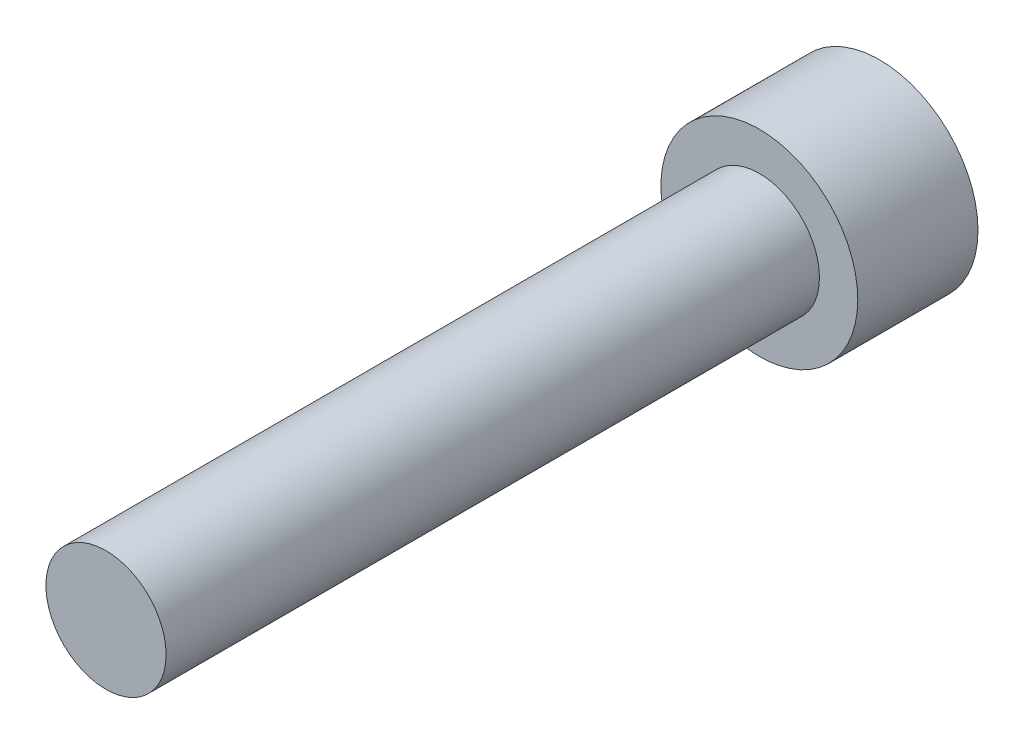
ISO-10303-21;
HEADER;
FILE_DESCRIPTION(('STEP AP214'),'2;1');
FILE_NAME('part.step','',(''),(''),'','','');
FILE_SCHEMA(('AUTOMOTIVE_DESIGN { 1 0 10303 214 1 1 1 1 }'));
ENDSEC;
DATA;
#1=APPLICATION_CONTEXT('core data for automotive mechanical design processes');
#2=APPLICATION_PROTOCOL_DEFINITION('international standard','automotive_design',2000,#1);
#3=PRODUCT_CONTEXT('',#1,'mechanical');
#4=PRODUCT('Part','Part','',(#3));
#5=PRODUCT_RELATED_PRODUCT_CATEGORY('part','',(#4));
#6=PRODUCT_DEFINITION_FORMATION('','',#4);
#7=PRODUCT_DEFINITION_CONTEXT('part definition',#1,'design');
#8=PRODUCT_DEFINITION('design','',#6,#7);
#9=PRODUCT_DEFINITION_SHAPE('','',#8);
#10=(LENGTH_UNIT() NAMED_UNIT(*) SI_UNIT(.MILLI.,.METRE.));
#11=(NAMED_UNIT(*) PLANE_ANGLE_UNIT() SI_UNIT($,.RADIAN.));
#12=(NAMED_UNIT(*) SI_UNIT($,.STERADIAN.) SOLID_ANGLE_UNIT());
#13=UNCERTAINTY_MEASURE_WITH_UNIT(LENGTH_MEASURE(1.E-05),#10,'distance_accuracy_value','');
#14=(GEOMETRIC_REPRESENTATION_CONTEXT(3) GLOBAL_UNCERTAINTY_ASSIGNED_CONTEXT((#13)) GLOBAL_UNIT_ASSIGNED_CONTEXT((#10,
#11,#12)) REPRESENTATION_CONTEXT('',''));
#15=CARTESIAN_POINT('',(0.,0.,0.));
#16=DIRECTION('',(0.,0.,1.));
#17=DIRECTION('',(1.,0.,0.));
#18=AXIS2_PLACEMENT_3D('',#15,#16,#17);
#19=CARTESIAN_POINT('',(0.,-2.8702,-3.5052));
#20=DIRECTION('',(0.,0.,-1.));
#21=DIRECTION('',(-1.,0.,0.));
#22=AXIS2_PLACEMENT_3D('',#19,#20,#21);
#23=PLANE('',#22);
#24=DIRECTION('',(0.866025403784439,-0.5,0.));
#25=VECTOR('',#24,1.);
#26=CARTESIAN_POINT('',(0.,1.5984519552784,-3.5052));
#27=LINE('',#26,#25);
#28=CARTESIAN_POINT('',(0.,1.5984519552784,-3.5052));
#29=VERTEX_POINT('',#28);
#30=CARTESIAN_POINT('',(1.3843,0.799225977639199,-3.5052));
#31=VERTEX_POINT('',#30);
#32=EDGE_CURVE('E46',#29,#31,#27,.T.);
#33=ORIENTED_EDGE('',*,*,#32,.F.);
#34=DIRECTION('',(0.866025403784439,0.5,0.));
#35=VECTOR('',#34,1.);
#36=CARTESIAN_POINT('',(-1.3843,0.7992259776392,-3.5052));
#37=LINE('',#36,#35);
#38=CARTESIAN_POINT('',(-1.3843,0.7992259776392,-3.5052));
#39=VERTEX_POINT('',#38);
#40=EDGE_CURVE('E129',#39,#29,#37,.T.);
#41=ORIENTED_EDGE('',*,*,#40,.F.);
#42=DIRECTION('',(0.,1.,0.));
#43=VECTOR('',#42,1.);
#44=CARTESIAN_POINT('',(-1.3843,-0.799225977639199,-3.5052));
#45=LINE('',#44,#43);
#46=CARTESIAN_POINT('',(-1.3843,-0.799225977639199,-3.5052));
#47=VERTEX_POINT('',#46);
#48=EDGE_CURVE('E127',#47,#39,#45,.T.);
#49=ORIENTED_EDGE('',*,*,#48,.F.);
#50=DIRECTION('',(-0.866025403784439,0.5,0.));
#51=VECTOR('',#50,1.);
#52=CARTESIAN_POINT('',(0.,-1.5984519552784,-3.5052));
#53=LINE('',#52,#51);
#54=CARTESIAN_POINT('',(0.,-1.5984519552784,-3.5052));
#55=VERTEX_POINT('',#54);
#56=EDGE_CURVE('E94',#55,#47,#53,.T.);
#57=ORIENTED_EDGE('',*,*,#56,.F.);
#58=DIRECTION('',(-0.866025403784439,-0.5,0.));
#59=VECTOR('',#58,1.);
#60=CARTESIAN_POINT('',(1.3843,-0.799225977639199,-3.5052));
#61=LINE('',#60,#59);
#62=CARTESIAN_POINT('',(1.3843,-0.799225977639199,-3.5052));
#63=VERTEX_POINT('',#62);
#64=EDGE_CURVE('E123',#63,#55,#61,.T.);
#65=ORIENTED_EDGE('',*,*,#64,.F.);
#66=DIRECTION('',(0.,-1.,0.));
#67=VECTOR('',#66,1.);
#68=CARTESIAN_POINT('',(1.3843,0.799225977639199,-3.5052));
#69=LINE('',#68,#67);
#70=EDGE_CURVE('E120',#31,#63,#69,.T.);
#71=ORIENTED_EDGE('',*,*,#70,.F.);
#72=EDGE_LOOP('',(#33,#41,#49,#57,#65,#71));
#73=FACE_BOUND('',#72,.T.);
#74=CARTESIAN_POINT('',(0.,0.,-3.5052));
#75=DIRECTION('',(0.,0.,1.));
#76=DIRECTION('',(1.,0.,0.));
#77=AXIS2_PLACEMENT_3D('',#74,#75,#76);
#78=CIRCLE('',#77,2.8702);
#79=CARTESIAN_POINT('',(2.8702,0.,-3.5052));
#80=VERTEX_POINT('',#79);
#81=EDGE_CURVE('E11',#80,#80,#78,.T.);
#82=ORIENTED_EDGE('',*,*,#81,.F.);
#83=EDGE_LOOP('',(#82));
#84=FACE_BOUND('',#83,.T.);
#85=ADVANCED_FACE('F32',(#73,#84),#23,.T.);
#86=CARTESIAN_POINT('',(0.,0.,19.05));
#87=DIRECTION('',(0.,0.,1.));
#88=DIRECTION('',(1.,0.,0.));
#89=AXIS2_PLACEMENT_3D('',#86,#87,#88);
#90=CYLINDRICAL_SURFACE('',#89,2.8702);
#91=ORIENTED_EDGE('',*,*,#81,.T.);
#92=EDGE_LOOP('',(#91));
#93=FACE_BOUND('',#92,.T.);
#94=CARTESIAN_POINT('',(0.,0.,0.));
#95=DIRECTION('',(0.,0.,1.));
#96=DIRECTION('',(1.,0.,0.));
#97=AXIS2_PLACEMENT_3D('',#94,#95,#96);
#98=CIRCLE('',#97,2.8702);
#99=CARTESIAN_POINT('',(2.8702,0.,0.));
#100=VERTEX_POINT('',#99);
#101=EDGE_CURVE('E39',#100,#100,#98,.T.);
#102=ORIENTED_EDGE('',*,*,#101,.F.);
#103=EDGE_LOOP('',(#102));
#104=FACE_BOUND('',#103,.T.);
#105=ADVANCED_FACE('F149',(#93,#104),#90,.T.);
#106=CARTESIAN_POINT('',(0.,-1.7526,0.));
#107=DIRECTION('',(0.,0.,1.));
#108=DIRECTION('',(1.,0.,0.));
#109=AXIS2_PLACEMENT_3D('',#106,#107,#108);
#110=PLANE('',#109);
#111=ORIENTED_EDGE('',*,*,#101,.T.);
#112=EDGE_LOOP('',(#111));
#113=FACE_BOUND('',#112,.T.);
#114=CARTESIAN_POINT('',(0.,0.,0.));
#115=DIRECTION('',(0.,0.,1.));
#116=DIRECTION('',(1.,0.,0.));
#117=AXIS2_PLACEMENT_3D('',#114,#115,#116);
#118=CIRCLE('',#117,1.7526);
#119=CARTESIAN_POINT('',(1.7526,0.,0.));
#120=VERTEX_POINT('',#119);
#121=EDGE_CURVE('E141',#120,#120,#118,.T.);
#122=ORIENTED_EDGE('',*,*,#121,.F.);
#123=EDGE_LOOP('',(#122));
#124=FACE_BOUND('',#123,.T.);
#125=ADVANCED_FACE('F146',(#113,#124),#110,.T.);
#126=CARTESIAN_POINT('',(0.,0.,19.05));
#127=DIRECTION('',(0.,0.,1.));
#128=DIRECTION('',(1.,0.,0.));
#129=AXIS2_PLACEMENT_3D('',#126,#127,#128);
#130=CYLINDRICAL_SURFACE('',#129,1.7526);
#131=ORIENTED_EDGE('',*,*,#121,.T.);
#132=EDGE_LOOP('',(#131));
#133=FACE_BOUND('',#132,.T.);
#134=CARTESIAN_POINT('',(0.,0.,19.05));
#135=DIRECTION('',(0.,0.,1.));
#136=DIRECTION('',(1.,0.,0.));
#137=AXIS2_PLACEMENT_3D('',#134,#135,#136);
#138=CIRCLE('',#137,1.7526);
#139=CARTESIAN_POINT('',(1.7526,0.,19.05));
#140=VERTEX_POINT('',#139);
#141=EDGE_CURVE('E133',#140,#140,#138,.T.);
#142=ORIENTED_EDGE('',*,*,#141,.F.);
#143=EDGE_LOOP('',(#142));
#144=FACE_BOUND('',#143,.T.);
#145=ADVANCED_FACE('F156',(#133,#144),#130,.T.);
#146=CARTESIAN_POINT('',(0.,0.,19.05));
#147=DIRECTION('',(0.,0.,1.));
#148=DIRECTION('',(1.,0.,0.));
#149=AXIS2_PLACEMENT_3D('',#146,#147,#148);
#150=PLANE('',#149);
#151=ORIENTED_EDGE('',*,*,#141,.T.);
#152=EDGE_LOOP('',(#151));
#153=FACE_BOUND('',#152,.T.);
#154=ADVANCED_FACE('F162',(#153),#150,.T.);
#155=CARTESIAN_POINT('',(0.,1.5984519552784,-1.4732));
#156=DIRECTION('',(0.5,0.866025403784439,0.));
#157=DIRECTION('',(-0.866025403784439,0.5,0.));
#158=AXIS2_PLACEMENT_3D('',#155,#156,#157);
#159=PLANE('',#158);
#160=ORIENTED_EDGE('',*,*,#32,.T.);
#161=DIRECTION('',(0.,0.,-1.));
#162=VECTOR('',#161,1.);
#163=CARTESIAN_POINT('',(1.3843,0.799225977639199,-1.4732));
#164=LINE('',#163,#162);
#165=CARTESIAN_POINT('',(1.3843,0.799225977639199,-1.4732));
#166=VERTEX_POINT('',#165);
#167=EDGE_CURVE('E76',#166,#31,#164,.T.);
#168=ORIENTED_EDGE('',*,*,#167,.F.);
#169=DIRECTION('',(0.866025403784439,-0.5,0.));
#170=VECTOR('',#169,1.);
#171=CARTESIAN_POINT('',(0.,1.5984519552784,-1.4732));
#172=LINE('',#171,#170);
#173=CARTESIAN_POINT('',(0.,1.5984519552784,-1.4732));
#174=VERTEX_POINT('',#173);
#175=EDGE_CURVE('E131',#174,#166,#172,.T.);
#176=ORIENTED_EDGE('',*,*,#175,.F.);
#177=DIRECTION('',(0.,0.,-1.));
#178=VECTOR('',#177,1.);
#179=CARTESIAN_POINT('',(0.,1.5984519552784,-1.4732));
#180=LINE('',#179,#178);
#181=EDGE_CURVE('E54',#174,#29,#180,.T.);
#182=ORIENTED_EDGE('',*,*,#181,.T.);
#183=EDGE_LOOP('',(#160,#168,#176,#182));
#184=FACE_BOUND('',#183,.T.);
#185=ADVANCED_FACE('F166',(#184),#159,.F.);
#186=CARTESIAN_POINT('',(-1.3843,0.7992259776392,-1.4732));
#187=DIRECTION('',(-0.5,0.866025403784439,0.));
#188=DIRECTION('',(-0.866025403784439,-0.5,0.));
#189=AXIS2_PLACEMENT_3D('',#186,#187,#188);
#190=PLANE('',#189);
#191=ORIENTED_EDGE('',*,*,#40,.T.);
#192=ORIENTED_EDGE('',*,*,#181,.F.);
#193=DIRECTION('',(0.866025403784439,0.5,0.));
#194=VECTOR('',#193,1.);
#195=CARTESIAN_POINT('',(-1.3843,0.7992259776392,-1.4732));
#196=LINE('',#195,#194);
#197=CARTESIAN_POINT('',(-1.3843,0.7992259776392,-1.4732));
#198=VERTEX_POINT('',#197);
#199=EDGE_CURVE('E106',#198,#174,#196,.T.);
#200=ORIENTED_EDGE('',*,*,#199,.F.);
#201=DIRECTION('',(0.,0.,-1.));
#202=VECTOR('',#201,1.);
#203=CARTESIAN_POINT('',(-1.3843,0.7992259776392,-1.4732));
#204=LINE('',#203,#202);
#205=EDGE_CURVE('E98',#198,#39,#204,.T.);
#206=ORIENTED_EDGE('',*,*,#205,.T.);
#207=EDGE_LOOP('',(#191,#192,#200,#206));
#208=FACE_BOUND('',#207,.T.);
#209=ADVANCED_FACE('F170',(#208),#190,.F.);
#210=CARTESIAN_POINT('',(-1.3843,-0.799225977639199,-1.4732));
#211=DIRECTION('',(-1.,0.,0.));
#212=DIRECTION('',(0.,0.,1.));
#213=AXIS2_PLACEMENT_3D('',#210,#211,#212);
#214=PLANE('',#213);
#215=ORIENTED_EDGE('',*,*,#48,.T.);
#216=ORIENTED_EDGE('',*,*,#205,.F.);
#217=DIRECTION('',(0.,1.,0.));
#218=VECTOR('',#217,1.);
#219=CARTESIAN_POINT('',(-1.3843,-0.799225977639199,-1.4732));
#220=LINE('',#219,#218);
#221=CARTESIAN_POINT('',(-1.3843,-0.799225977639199,-1.4732));
#222=VERTEX_POINT('',#221);
#223=EDGE_CURVE('E102',#222,#198,#220,.T.);
#224=ORIENTED_EDGE('',*,*,#223,.F.);
#225=DIRECTION('',(0.,0.,-1.));
#226=VECTOR('',#225,1.);
#227=CARTESIAN_POINT('',(-1.3843,-0.799225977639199,-1.4732));
#228=LINE('',#227,#226);
#229=EDGE_CURVE('E87',#222,#47,#228,.T.);
#230=ORIENTED_EDGE('',*,*,#229,.T.);
#231=EDGE_LOOP('',(#215,#216,#224,#230));
#232=FACE_BOUND('',#231,.T.);
#233=ADVANCED_FACE('F103',(#232),#214,.F.);
#234=CARTESIAN_POINT('',(0.,-1.5984519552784,-1.4732));
#235=DIRECTION('',(-0.5,-0.866025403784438,0.));
#236=DIRECTION('',(0.866025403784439,-0.5,0.));
#237=AXIS2_PLACEMENT_3D('',#234,#235,#236);
#238=PLANE('',#237);
#239=ORIENTED_EDGE('',*,*,#56,.T.);
#240=ORIENTED_EDGE('',*,*,#229,.F.);
#241=DIRECTION('',(-0.866025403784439,0.5,0.));
#242=VECTOR('',#241,1.);
#243=CARTESIAN_POINT('',(0.,-1.5984519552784,-1.4732));
#244=LINE('',#243,#242);
#245=CARTESIAN_POINT('',(0.,-1.5984519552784,-1.4732));
#246=VERTEX_POINT('',#245);
#247=EDGE_CURVE('E91',#246,#222,#244,.T.);
#248=ORIENTED_EDGE('',*,*,#247,.F.);
#249=DIRECTION('',(0.,0.,-1.));
#250=VECTOR('',#249,1.);
#251=CARTESIAN_POINT('',(0.,-1.5984519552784,-1.4732));
#252=LINE('',#251,#250);
#253=EDGE_CURVE('E99',#246,#55,#252,.T.);
#254=ORIENTED_EDGE('',*,*,#253,.T.);
#255=EDGE_LOOP('',(#239,#240,#248,#254));
#256=FACE_BOUND('',#255,.T.);
#257=ADVANCED_FACE('F89',(#256),#238,.F.);
#258=CARTESIAN_POINT('',(1.3843,-0.799225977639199,-1.4732));
#259=DIRECTION('',(0.5,-0.866025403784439,0.));
#260=DIRECTION('',(0.866025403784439,0.5,0.));
#261=AXIS2_PLACEMENT_3D('',#258,#259,#260);
#262=PLANE('',#261);
#263=ORIENTED_EDGE('',*,*,#64,.T.);
#264=ORIENTED_EDGE('',*,*,#253,.F.);
#265=DIRECTION('',(-0.866025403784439,-0.5,0.));
#266=VECTOR('',#265,1.);
#267=CARTESIAN_POINT('',(1.3843,-0.799225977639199,-1.4732));
#268=LINE('',#267,#266);
#269=CARTESIAN_POINT('',(1.3843,-0.799225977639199,-1.4732));
#270=VERTEX_POINT('',#269);
#271=EDGE_CURVE('E112',#270,#246,#268,.T.);
#272=ORIENTED_EDGE('',*,*,#271,.F.);
#273=DIRECTION('',(0.,0.,-1.));
#274=VECTOR('',#273,1.);
#275=CARTESIAN_POINT('',(1.3843,-0.799225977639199,-1.4732));
#276=LINE('',#275,#274);
#277=EDGE_CURVE('E136',#270,#63,#276,.T.);
#278=ORIENTED_EDGE('',*,*,#277,.T.);
#279=EDGE_LOOP('',(#263,#264,#272,#278));
#280=FACE_BOUND('',#279,.T.);
#281=ADVANCED_FACE('F174',(#280),#262,.F.);
#282=CARTESIAN_POINT('',(1.3843,0.799225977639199,-1.4732));
#283=DIRECTION('',(1.,0.,0.));
#284=DIRECTION('',(0.,1.,0.));
#285=AXIS2_PLACEMENT_3D('',#282,#283,#284);
#286=PLANE('',#285);
#287=ORIENTED_EDGE('',*,*,#70,.T.);
#288=ORIENTED_EDGE('',*,*,#277,.F.);
#289=DIRECTION('',(0.,-1.,0.));
#290=VECTOR('',#289,1.);
#291=CARTESIAN_POINT('',(1.3843,0.799225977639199,-1.4732));
#292=LINE('',#291,#290);
#293=EDGE_CURVE('E114',#166,#270,#292,.T.);
#294=ORIENTED_EDGE('',*,*,#293,.F.);
#295=ORIENTED_EDGE('',*,*,#167,.T.);
#296=EDGE_LOOP('',(#287,#288,#294,#295));
#297=FACE_BOUND('',#296,.T.);
#298=ADVANCED_FACE('F171',(#297),#286,.F.);
#299=CARTESIAN_POINT('',(1.3843,0.799225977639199,-1.4732));
#300=DIRECTION('',(0.,0.,-1.));
#301=DIRECTION('',(-1.,0.,0.));
#302=AXIS2_PLACEMENT_3D('',#299,#300,#301);
#303=PLANE('',#302);
#304=ORIENTED_EDGE('',*,*,#175,.T.);
#305=ORIENTED_EDGE('',*,*,#293,.T.);
#306=ORIENTED_EDGE('',*,*,#271,.T.);
#307=ORIENTED_EDGE('',*,*,#247,.T.);
#308=ORIENTED_EDGE('',*,*,#223,.T.);
#309=ORIENTED_EDGE('',*,*,#199,.T.);
#310=EDGE_LOOP('',(#304,#305,#306,#307,#308,#309));
#311=FACE_BOUND('',#310,.T.);
#312=ADVANCED_FACE('F109',(#311),#303,.T.);
#313=CLOSED_SHELL('',(#85,#105,#125,#145,#154,#185,#209,#233,#257,#281,#298,#312));
#314=MANIFOLD_SOLID_BREP('B2',#313);
#315=ADVANCED_BREP_SHAPE_REPRESENTATION('',(#18,#314),#14);
#316=SHAPE_DEFINITION_REPRESENTATION(#9,#315);
ENDSEC;
END-ISO-10303-21;
